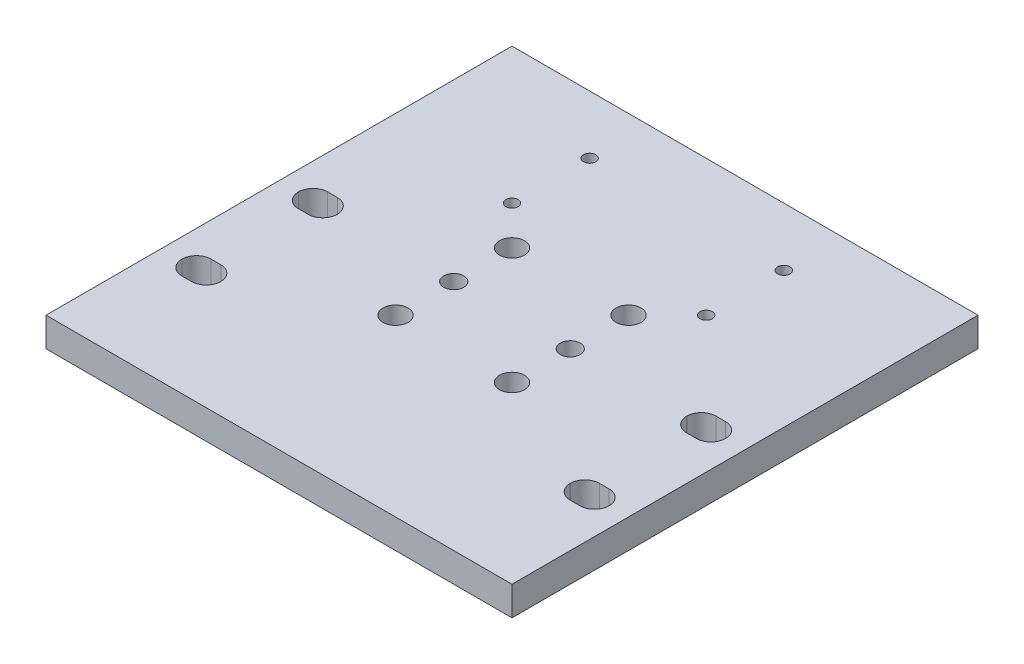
from build123d import *

# Parameters (mm, degrees)
SKETCH1_W                    = 152.4
SKETCH1_H                    = 152.4
EXTRUDE1_DEPTH               = 9.525
CUT_EXTRUDE1_DEPTH           = 216.736518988
F_10_32_TAPPED_HOLE1_D       = 4.0386
F_10_32_TAPPED_HOLE1_DEPTH   = 13.6144
F_10_32_TAPPED_HOLE1_TIP     = 1.213317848
SKETCH5_R                    = 4.09575
CUT_EXTRUDE2_DEPTH           = 216.736518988
F_5_16_18_TAPPED_HOLE1_D     = 6.5278
F_5_16_18_TAPPED_HOLE1_DEPTH = 22.9362
F_5_16_18_TAPPED_HOLE1_TIP   = 1.961148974


with BuildPart() as part:
    # Sketch1 → Extrude1 (new body)
    with BuildSketch(Plane(origin=(0, 0, 0), x_dir=(1, 0, 0), z_dir=(0, 1, 0))):
        with Locations((76.2, 76.2)):
            Rectangle(SKETCH1_W, SKETCH1_H)
    extrude(amount=EXTRUDE1_DEPTH)

    # Sketch2 → Cut-Extrude1 (cut, through all)
    with BuildSketch(Plane(origin=(0, 9.525, 0), x_dir=(1, 0, 0), z_dir=(0, 1, 0))):
        with BuildLine():
            Line((141.2875, 33.3248), (138.1125, 33.3248))
            ThreePointArc((138.1125, 33.3248), (134.744903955, 34.719703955), (133.35, 38.0873))
            Line((133.35, 38.0873), (133.35, 38.1127))
            ThreePointArc((133.35, 38.1127), (134.744903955, 41.480296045), (138.1125, 42.8752))
            Line((138.1125, 42.8752), (141.2875, 42.8752))
            ThreePointArc((141.2875, 42.8752), (144.655096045, 41.480296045), (146.05, 38.1127))
            Line((146.05, 38.1127), (146.05, 38.0873))
            ThreePointArc((146.05, 38.0873), (144.655096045, 34.719703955), (141.2875, 33.3248))
        make_face()
        with BuildLine():
            Line((19.05, 38.0873), (19.05, 38.1127))
            ThreePointArc((19.05, 38.1127), (17.655096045, 41.480296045), (14.2875, 42.8752))
            Line((14.2875, 42.8752), (11.1125, 42.8752))
            ThreePointArc((11.1125, 42.8752), (7.744903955, 41.480296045), (6.35, 38.1127))
            Line((6.35, 38.1127), (6.35, 38.0873))
            ThreePointArc((6.35, 38.0873), (7.744903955, 34.719703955), (11.1125, 33.3248))
            Line((11.1125, 33.3248), (14.2875, 33.3248))
            ThreePointArc((14.2875, 33.3248), (17.655096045, 34.719703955), (19.05, 38.0873))
        make_face()
        with BuildLine():
            Line((11.1125, 80.9752), (14.2875, 80.9752))
            ThreePointArc((14.2875, 80.9752), (17.655096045, 79.580296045), (19.05, 76.2127))
            Line((19.05, 76.2127), (19.05, 76.1873))
            ThreePointArc((19.05, 76.1873), (17.655096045, 72.819703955), (14.2875, 71.4248))
            Line((14.2875, 71.4248), (11.1125, 71.4248))
            ThreePointArc((11.1125, 71.4248), (7.744903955, 72.819703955), (6.35, 76.1873))
            Line((6.35, 76.1873), (6.35, 76.2127))
            ThreePointArc((6.35, 76.2127), (7.744903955, 79.580296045), (11.1125, 80.9752))
        make_face()
        with BuildLine():
            Line((133.35, 76.2127), (133.35, 76.1873))
            ThreePointArc((133.35, 76.1873), (134.744903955, 72.819703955), (138.1125, 71.4248))
            Line((138.1125, 71.4248), (141.2875, 71.4248))
            ThreePointArc((141.2875, 71.4248), (144.655096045, 72.819703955), (146.05, 76.1873))
            Line((146.05, 76.1873), (146.05, 76.2127))
            ThreePointArc((146.05, 76.2127), (144.655096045, 79.580296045), (141.2875, 80.9752))
            Line((141.2875, 80.9752), (138.1125, 80.9752))
            ThreePointArc((138.1125, 80.9752), (134.744903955, 79.580296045), (133.35, 76.2127))
        make_face()
    extrude(amount=-CUT_EXTRUDE1_DEPTH, mode=Mode.SUBTRACT)

    # 10-32 Tapped Hole1
    with Locations(Plane(origin=(0, 9.525, 0), x_dir=(-1, 0, 0), z_dir=(0, 1, 0))):
        with Locations((-44.45, -107.95), (-107.95, -107.95), (-107.95, -133.35), (-44.45, -133.35)):
            Hole(F_10_32_TAPPED_HOLE1_D / 2, depth=F_10_32_TAPPED_HOLE1_DEPTH)
            with Locations((0, 0, -(F_10_32_TAPPED_HOLE1_DEPTH + F_10_32_TAPPED_HOLE1_TIP / 2))):  # 118° drill point
                Cone(0, F_10_32_TAPPED_HOLE1_D / 2, F_10_32_TAPPED_HOLE1_TIP, mode=Mode.SUBTRACT)

    # Sketch5 → Cut-Extrude2 (cut, through all)
    with BuildSketch(Plane(origin=(0, 9.525, 0), x_dir=(1, 0, 0), z_dir=(0, 1, 0))):
        with Locations(Location((57.15, 95.25, 0), (0, 0, 270))):
            Circle(SKETCH5_R)
        with Locations(Location((95.25, 95.25, 0), (0, 0, 270))):
            Circle(SKETCH5_R)
        with Locations(Location((57.15, 57.15, 0), (0, 0, 270))):
            Circle(SKETCH5_R)
        with Locations(Location((95.25, 57.15, 0), (0, 0, 270))):
            Circle(SKETCH5_R)
    extrude(amount=-CUT_EXTRUDE2_DEPTH, mode=Mode.SUBTRACT)

    # 5_16-18 Tapped Hole1
    with Locations(Plane(origin=(0, 9.525, 0), x_dir=(-1, 0, 0), z_dir=(0, 1, 0))):
        with Locations((-57.15, -76.2), (-95.25, -76.2)):
            Hole(F_5_16_18_TAPPED_HOLE1_D / 2, depth=F_5_16_18_TAPPED_HOLE1_DEPTH)
            with Locations((0, 0, -(F_5_16_18_TAPPED_HOLE1_DEPTH + F_5_16_18_TAPPED_HOLE1_TIP / 2))):  # 118° drill point
                Cone(0, F_5_16_18_TAPPED_HOLE1_D / 2, F_5_16_18_TAPPED_HOLE1_TIP, mode=Mode.SUBTRACT)


solid = part.part
